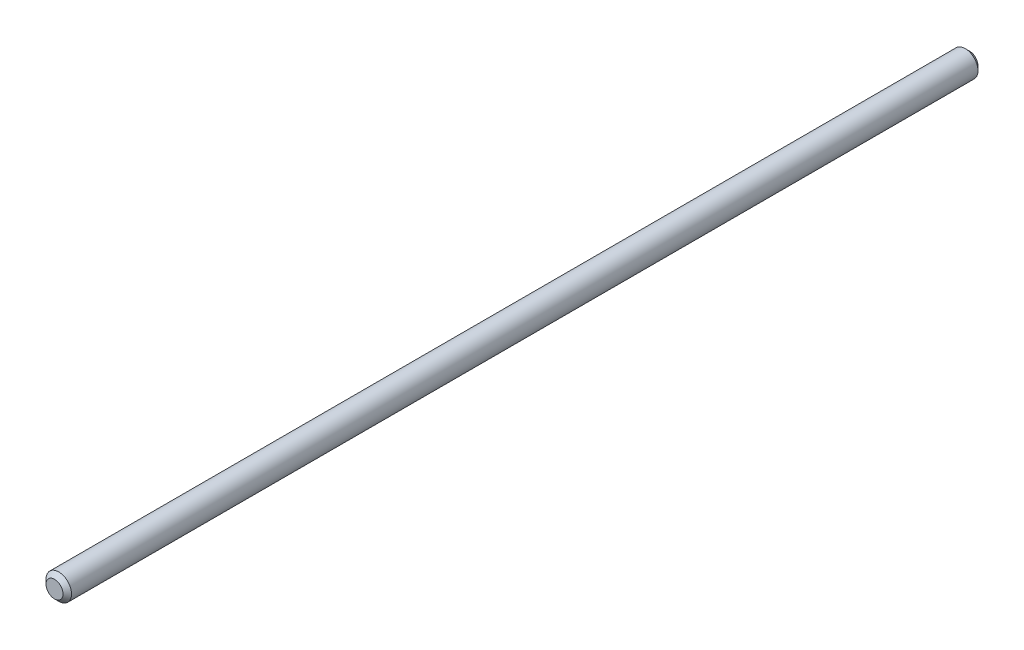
from build123d import *

# Parameters (mm, degrees)
ESQUISSE1_R        = 3
BOSS_EXTRU_1_DEPTH = 215
CHANFREIN1_SIZE    = 1
CHANFREIN2_SIZE    = 1


with BuildPart() as part:
    # Esquisse1 → Boss.-Extru.1 (new body)
    with BuildSketch(Plane.XY):
        Circle(ESQUISSE1_R)
    extrude(amount=BOSS_EXTRU_1_DEPTH)

    # Chanfrein1
    chanfrein1_edges = [part.edges().sort_by_distance(p)[0] for p in [
        (-3, 0, 215),
    ]]
    chamfer(chanfrein1_edges, length=CHANFREIN1_SIZE)

    # Chanfrein2
    chanfrein2_edges = [part.edges().sort_by_distance(p)[0] for p in [
        (-3, 0, 0),
    ]]
    chamfer(chanfrein2_edges, length=CHANFREIN2_SIZE)


solid = part.part
